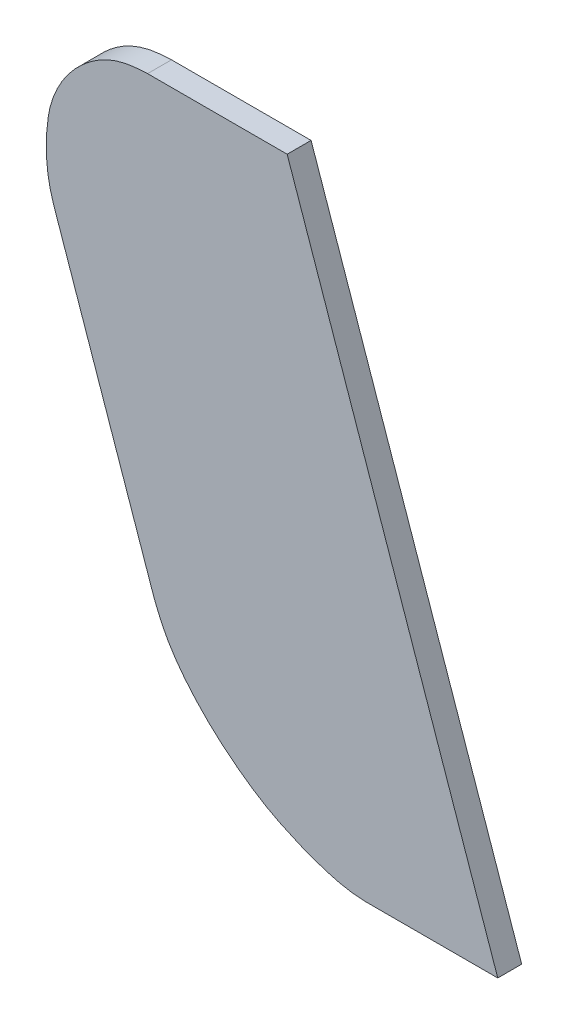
ISO-10303-21;
HEADER;
FILE_DESCRIPTION(('STEP AP214'),'2;1');
FILE_NAME('part.step','',(''),(''),'','','');
FILE_SCHEMA(('AUTOMOTIVE_DESIGN { 1 0 10303 214 1 1 1 1 }'));
ENDSEC;
DATA;
#1=APPLICATION_CONTEXT('core data for automotive mechanical design processes');
#2=APPLICATION_PROTOCOL_DEFINITION('international standard','automotive_design',2000,#1);
#3=PRODUCT_CONTEXT('',#1,'mechanical');
#4=PRODUCT('Part','Part','',(#3));
#5=PRODUCT_RELATED_PRODUCT_CATEGORY('part','',(#4));
#6=PRODUCT_DEFINITION_FORMATION('','',#4);
#7=PRODUCT_DEFINITION_CONTEXT('part definition',#1,'design');
#8=PRODUCT_DEFINITION('design','',#6,#7);
#9=PRODUCT_DEFINITION_SHAPE('','',#8);
#10=(LENGTH_UNIT() NAMED_UNIT(*) SI_UNIT(.MILLI.,.METRE.));
#11=(NAMED_UNIT(*) PLANE_ANGLE_UNIT() SI_UNIT($,.RADIAN.));
#12=(NAMED_UNIT(*) SI_UNIT($,.STERADIAN.) SOLID_ANGLE_UNIT());
#13=UNCERTAINTY_MEASURE_WITH_UNIT(LENGTH_MEASURE(1.E-05),#10,'distance_accuracy_value','');
#14=(GEOMETRIC_REPRESENTATION_CONTEXT(3) GLOBAL_UNCERTAINTY_ASSIGNED_CONTEXT((#13)) GLOBAL_UNIT_ASSIGNED_CONTEXT((#10,
#11,#12)) REPRESENTATION_CONTEXT('',''));
#15=CARTESIAN_POINT('',(0.,0.,0.));
#16=DIRECTION('',(0.,0.,1.));
#17=DIRECTION('',(1.,0.,0.));
#18=AXIS2_PLACEMENT_3D('',#15,#16,#17);
#19=CARTESIAN_POINT('',(0.,0.,0.8));
#20=DIRECTION('',(0.,0.,1.));
#21=DIRECTION('',(1.,0.,0.));
#22=AXIS2_PLACEMENT_3D('',#19,#20,#21);
#23=PLANE('',#22);
#24=DIRECTION('',(1.,0.,0.));
#25=VECTOR('',#24,1.);
#26=CARTESIAN_POINT('',(336.749341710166,203.769860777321,0.8));
#27=LINE('',#26,#25);
#28=CARTESIAN_POINT('',(336.749341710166,203.769860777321,0.8));
#29=VERTEX_POINT('',#28);
#30=CARTESIAN_POINT('',(332.31509172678,203.769860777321,0.8));
#31=VERTEX_POINT('',#30);
#32=EDGE_CURVE('E123',#29,#31,#27,.F.);
#33=ORIENTED_EDGE('',*,*,#32,.F.);
#34=DIRECTION('',(-0.32724357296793,0.944940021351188,0.));
#35=VECTOR('',#34,1.);
#36=CARTESIAN_POINT('',(329.704563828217,224.112177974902,0.8));
#37=LINE('',#36,#35);
#38=CARTESIAN_POINT('',(329.704563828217,224.112177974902,0.8));
#39=VERTEX_POINT('',#38);
#40=EDGE_CURVE('E117',#39,#29,#37,.F.);
#41=ORIENTED_EDGE('',*,*,#40,.F.);
#42=DIRECTION('',(1.,0.,0.));
#43=VECTOR('',#42,1.);
#44=CARTESIAN_POINT('',(325.035835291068,224.112177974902,0.8));
#45=LINE('',#44,#43);
#46=CARTESIAN_POINT('',(325.035835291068,224.112177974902,0.8));
#47=VERTEX_POINT('',#46);
#48=EDGE_CURVE('E110',#47,#39,#45,.T.);
#49=ORIENTED_EDGE('',*,*,#48,.F.);
#50=CARTESIAN_POINT('',(321.659344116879,220.709633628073,0.8));
#51=CARTESIAN_POINT('',(321.663379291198,220.754957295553,0.8));
#52=CARTESIAN_POINT('',(321.667413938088,220.800284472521,0.8));
#53=CARTESIAN_POINT('',(321.675904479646,220.891007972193,0.8));
#54=CARTESIAN_POINT('',(321.68036135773,220.93640420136,0.8));
#55=CARTESIAN_POINT('',(321.690107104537,221.027146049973,0.8));
#56=CARTESIAN_POINT('',(321.695396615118,221.072491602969,0.8));
#57=CARTESIAN_POINT('',(321.707229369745,221.163053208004,0.8));
#58=CARTESIAN_POINT('',(321.713773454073,221.208269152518,0.8));
#59=CARTESIAN_POINT('',(321.728519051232,221.298396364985,0.8));
#60=CARTESIAN_POINT('',(321.736719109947,221.343307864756,0.8));
#61=CARTESIAN_POINT('',(321.75519630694,221.432682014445,0.8));
#62=CARTESIAN_POINT('',(321.765472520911,221.477144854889,0.8));
#63=CARTESIAN_POINT('',(321.793508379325,221.587175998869,0.8));
#64=CARTESIAN_POINT('',(321.812470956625,221.652439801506,0.8));
#65=CARTESIAN_POINT('',(321.854394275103,221.781708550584,0.8));
#66=CARTESIAN_POINT('',(321.877357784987,221.845712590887,0.8));
#67=CARTESIAN_POINT('',(321.926868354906,221.972233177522,0.8));
#68=CARTESIAN_POINT('',(321.953411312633,222.034751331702,0.8));
#69=CARTESIAN_POINT('',(322.009894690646,222.158233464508,0.8));
#70=CARTESIAN_POINT('',(322.039835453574,222.219197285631,0.8));
#71=CARTESIAN_POINT('',(322.119278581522,222.369926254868,0.8));
#72=CARTESIAN_POINT('',(322.170979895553,222.458554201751,0.8));
#73=CARTESIAN_POINT('',(322.254337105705,222.587694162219,0.8));
#74=CARTESIAN_POINT('',(322.283090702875,222.630107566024,0.8));
#75=CARTESIAN_POINT('',(322.342459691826,222.713611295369,0.8));
#76=CARTESIAN_POINT('',(322.373075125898,222.754701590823,0.8));
#77=CARTESIAN_POINT('',(322.467570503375,222.876054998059,0.8));
#78=CARTESIAN_POINT('',(322.534047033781,222.954319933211,0.8));
#79=CARTESIAN_POINT('',(322.638165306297,223.067624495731,0.8));
#80=CARTESIAN_POINT('',(322.673614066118,223.104718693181,0.8));
#81=CARTESIAN_POINT('',(322.745893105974,223.177537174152,0.8));
#82=CARTESIAN_POINT('',(322.782723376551,223.213261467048,0.8));
#83=CARTESIAN_POINT('',(322.895606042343,223.318441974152,0.8));
#84=CARTESIAN_POINT('',(322.973801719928,223.385633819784,0.8));
#85=CARTESIAN_POINT('',(323.135845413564,223.512828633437,0.8));
#86=CARTESIAN_POINT('',(323.219693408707,223.572831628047,0.8));
#87=CARTESIAN_POINT('',(323.392634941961,223.684358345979,0.8));
#88=CARTESIAN_POINT('',(323.481715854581,223.735901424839,0.8));
#89=CARTESIAN_POINT('',(323.61894110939,223.80600862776,0.8));
#90=CARTESIAN_POINT('',(323.665271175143,223.828171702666,0.8));
#91=CARTESIAN_POINT('',(323.759072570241,223.869929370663,0.8));
#92=CARTESIAN_POINT('',(323.806543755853,223.889524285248,0.8));
#93=CARTESIAN_POINT('',(323.916708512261,223.931496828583,0.8));
#94=CARTESIAN_POINT('',(323.979744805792,223.952978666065,0.8));
#95=CARTESIAN_POINT('',(324.107219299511,223.991447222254,0.8));
#96=CARTESIAN_POINT('',(324.171658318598,224.008431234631,0.8));
#97=CARTESIAN_POINT('',(324.269142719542,224.030457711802,0.8));
#98=CARTESIAN_POINT('',(324.301805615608,224.037229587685,0.8));
#99=CARTESIAN_POINT('',(324.367356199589,224.049581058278,0.8));
#100=CARTESIAN_POINT('',(324.400243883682,224.055160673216,0.8));
#101=CARTESIAN_POINT('',(324.499818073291,224.070378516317,0.8));
#102=CARTESIAN_POINT('',(324.566758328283,224.078350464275,0.8));
#103=CARTESIAN_POINT('',(324.70083829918,224.091364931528,0.8));
#104=CARTESIAN_POINT('',(324.767977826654,224.096409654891,0.8));
#105=CARTESIAN_POINT('',(324.902032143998,224.105023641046,0.8));
#106=CARTESIAN_POINT('',(324.968946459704,224.108599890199,0.8));
#107=CARTESIAN_POINT('',(325.035835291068,224.112177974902,0.8));
#108=B_SPLINE_CURVE_WITH_KNOTS('',3,(#50,#51,#52,#53,#54,#55,#56,#57,#58,#59,#60,#61,#62,#63,
#64,#65,#66,#67,#68,#69,#70,#71,#72,#73,#74,#75,#76,#77,#78,#79,#80,#81,#82,#83,#84,#85,#86,#87,
#88,#89,#90,#91,#92,#93,#94,#95,#96,#97,#98,#99,#100,#101,#102,#103,#104,#105,#106,#107),
.UNSPECIFIED.,.F.,.F.,(4,2,2,2,2,2,2,2,2,2,2,2,2,2,2,2,2,2,2,2,2,2,2,2,2,2,2,2,4),(0.,
0.136514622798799,0.273355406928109,0.410302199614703,0.547341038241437,0.68426006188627,
0.821118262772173,1.02485773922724,1.22873877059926,1.43238809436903,1.6360579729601,
1.94341118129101,2.09709089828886,2.25077410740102,2.55842837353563,2.71232710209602,
2.86622477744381,3.17512249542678,3.48401907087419,3.79219875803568,3.94620969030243,
4.10020132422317,4.29982067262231,4.49955986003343,4.59961383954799,4.69966612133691,
4.90178585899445,5.10375321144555,5.30474823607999),.UNSPECIFIED.);
#109=CARTESIAN_POINT('',(321.659344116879,220.709633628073,0.8));
#110=VERTEX_POINT('',#109);
#111=EDGE_CURVE('E98',#110,#47,#108,.T.);
#112=ORIENTED_EDGE('',*,*,#111,.F.);
#113=CARTESIAN_POINT('',(321.893822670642,218.740013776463,0.8));
#114=CARTESIAN_POINT('',(321.884042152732,218.772009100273,0.8));
#115=CARTESIAN_POINT('',(321.874260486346,218.804005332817,0.8));
#116=CARTESIAN_POINT('',(321.854890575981,218.86806565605,0.8));
#117=CARTESIAN_POINT('',(321.845302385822,218.900129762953,0.8));
#118=CARTESIAN_POINT('',(321.826522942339,218.9643668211,0.8));
#119=CARTESIAN_POINT('',(321.817331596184,218.99653974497,0.8));
#120=CARTESIAN_POINT('',(321.799538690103,219.061045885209,0.8));
#121=CARTESIAN_POINT('',(321.790937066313,219.093379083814,0.8));
#122=CARTESIAN_POINT('',(321.774564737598,219.158194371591,0.8));
#123=CARTESIAN_POINT('',(321.766792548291,219.190676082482,0.8));
#124=CARTESIAN_POINT('',(321.752158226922,219.255844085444,0.8));
#125=CARTESIAN_POINT('',(321.745296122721,219.288530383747,0.8));
#126=CARTESIAN_POINT('',(321.725936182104,219.386838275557,0.8));
#127=CARTESIAN_POINT('',(321.714666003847,219.452703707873,0.8));
#128=CARTESIAN_POINT('',(321.697453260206,219.567687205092,0.8));
#129=CARTESIAN_POINT('',(321.690887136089,219.616715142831,0.8));
#130=CARTESIAN_POINT('',(321.679055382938,219.714928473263,0.8));
#131=CARTESIAN_POINT('',(321.673789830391,219.764113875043,0.8));
#132=CARTESIAN_POINT('',(321.660062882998,219.911853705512,0.8));
#133=CARTESIAN_POINT('',(321.653667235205,220.010618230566,0.8));
#134=CARTESIAN_POINT('',(321.648844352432,220.159504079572,0.8));
#135=CARTESIAN_POINT('',(321.648041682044,220.20955874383,0.8));
#136=CARTESIAN_POINT('',(321.647837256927,220.309669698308,0.8));
#137=CARTESIAN_POINT('',(321.648435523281,220.359725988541,0.8));
#138=CARTESIAN_POINT('',(321.650526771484,220.459771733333,0.8));
#139=CARTESIAN_POINT('',(321.652018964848,220.509761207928,0.8));
#140=CARTESIAN_POINT('',(321.655454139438,220.60971282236,0.8));
#141=CARTESIAN_POINT('',(321.657397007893,220.659674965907,0.8));
#142=CARTESIAN_POINT('',(321.659344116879,220.709633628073,0.8));
#143=B_SPLINE_CURVE_WITH_KNOTS('',3,(#113,#114,#115,#116,#117,#118,#119,#120,#121,#122,#123,
#124,#125,#126,#127,#128,#129,#130,#131,#132,#133,#134,#135,#136,#137,#138,#139,#140,#141,#142),
.UNSPECIFIED.,.F.,.F.,(4,2,2,2,2,2,2,2,2,2,2,2,2,2,4),(0.,0.100372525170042,0.200772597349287,
0.301149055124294,0.40151462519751,0.501697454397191,0.601883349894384,0.802271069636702,
0.950650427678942,1.09903850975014,1.39573446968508,1.54589718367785,1.69606215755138,
1.84609487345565,1.99609008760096),.UNSPECIFIED.);
#144=CARTESIAN_POINT('',(321.893822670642,218.740013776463,0.8));
#145=VERTEX_POINT('',#144);
#146=EDGE_CURVE('E24',#145,#110,#143,.T.);
#147=ORIENTED_EDGE('',*,*,#146,.F.);
#148=DIRECTION('',(0.32702335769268,-0.945016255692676,0.));
#149=VECTOR('',#148,1.);
#150=CARTESIAN_POINT('',(325.249471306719,209.043022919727,0.8));
#151=LINE('',#150,#149);
#152=CARTESIAN_POINT('',(325.249471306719,209.043022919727,0.8));
#153=VERTEX_POINT('',#152);
#154=EDGE_CURVE('E83',#153,#145,#151,.F.);
#155=ORIENTED_EDGE('',*,*,#154,.F.);
#156=CARTESIAN_POINT('',(330.131835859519,204.316977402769,0.8));
#157=CARTESIAN_POINT('',(330.07072773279,204.343575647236,0.8));
#158=CARTESIAN_POINT('',(330.009616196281,204.370173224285,0.8));
#159=CARTESIAN_POINT('',(329.887551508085,204.423781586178,0.8));
#160=CARTESIAN_POINT('',(329.826598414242,204.450792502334,0.8));
#161=CARTESIAN_POINT('',(329.705053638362,204.505626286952,0.8));
#162=CARTESIAN_POINT('',(329.644461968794,204.533449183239,0.8));
#163=CARTESIAN_POINT('',(329.523845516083,204.5902849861,0.8));
#164=CARTESIAN_POINT('',(329.463820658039,204.619297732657,0.8));
#165=CARTESIAN_POINT('',(329.344185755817,204.67915471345,0.8));
#166=CARTESIAN_POINT('',(329.284581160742,204.710009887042,0.8));
#167=CARTESIAN_POINT('',(329.166276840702,204.773412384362,0.8));
#168=CARTESIAN_POINT('',(329.107577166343,204.805959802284,0.8));
#169=CARTESIAN_POINT('',(328.932811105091,204.905890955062,0.8));
#170=CARTESIAN_POINT('',(328.818055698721,204.975574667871,0.8));
#171=CARTESIAN_POINT('',(328.552473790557,205.14531478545,0.8));
#172=CARTESIAN_POINT('',(328.403008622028,205.247494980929,0.8));
#173=CARTESIAN_POINT('',(328.109541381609,205.45963184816,0.8));
#174=CARTESIAN_POINT('',(327.965544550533,205.569595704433,0.8));
#175=CARTESIAN_POINT('',(327.682525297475,205.795907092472,0.8));
#176=CARTESIAN_POINT('',(327.543505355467,205.912257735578,0.8));
#177=CARTESIAN_POINT('',(327.339939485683,206.091973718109,0.8));
#178=CARTESIAN_POINT('',(327.273011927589,206.152645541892,0.8));
#179=CARTESIAN_POINT('',(327.14091073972,206.275865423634,0.8));
#180=CARTESIAN_POINT('',(327.075737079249,206.338413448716,0.8));
#181=CARTESIAN_POINT('',(326.883057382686,206.528747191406,0.8));
#182=CARTESIAN_POINT('',(326.758279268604,206.65932232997,0.8));
#183=CARTESIAN_POINT('',(326.57673731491,206.86016881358,0.8));
#184=CARTESIAN_POINT('',(326.517169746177,206.927937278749,0.8));
#185=CARTESIAN_POINT('',(326.399980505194,207.065135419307,0.8));
#186=CARTESIAN_POINT('',(326.342358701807,207.134564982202,0.8));
#187=CARTESIAN_POINT('',(326.212329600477,207.296671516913,0.8));
#188=CARTESIAN_POINT('',(326.140741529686,207.390009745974,0.8));
#189=CARTESIAN_POINT('',(326.002474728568,207.58022516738,0.8));
#190=CARTESIAN_POINT('',(325.935794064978,207.677100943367,0.8));
#191=CARTESIAN_POINT('',(325.840108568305,207.8251835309,0.8));
#192=CARTESIAN_POINT('',(325.80893954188,207.87499960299,0.8));
#193=CARTESIAN_POINT('',(325.748140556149,207.975565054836,0.8));
#194=CARTESIAN_POINT('',(325.718510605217,208.026314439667,0.8));
#195=CARTESIAN_POINT('',(325.660811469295,208.12888401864,0.8));
#196=CARTESIAN_POINT('',(325.632746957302,208.180706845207,0.8));
#197=CARTESIAN_POINT('',(325.578433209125,208.285290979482,0.8));
#198=CARTESIAN_POINT('',(325.55218382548,208.338052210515,0.8));
#199=CARTESIAN_POINT('',(325.501399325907,208.444474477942,0.8));
#200=CARTESIAN_POINT('',(325.476866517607,208.498136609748,0.8));
#201=CARTESIAN_POINT('',(325.429082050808,208.606035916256,0.8));
#202=CARTESIAN_POINT('',(325.405830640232,208.660273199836,0.8));
#203=CARTESIAN_POINT('',(325.360169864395,208.769186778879,0.8));
#204=CARTESIAN_POINT('',(325.337761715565,208.823863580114,0.8));
#205=CARTESIAN_POINT('',(325.293393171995,208.933369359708,0.8));
#206=CARTESIAN_POINT('',(325.271432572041,208.988198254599,0.8));
#207=CARTESIAN_POINT('',(325.249471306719,209.043022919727,0.8));
#208=B_SPLINE_CURVE_WITH_KNOTS('',3,(#156,#157,#158,#159,#160,#161,#162,#163,#164,#165,#166,
#167,#168,#169,#170,#171,#172,#173,#174,#175,#176,#177,#178,#179,#180,#181,#182,#183,#184,#185,
#186,#187,#188,#189,#190,#191,#192,#193,#194,#195,#196,#197,#198,#199,#200,#201,#202,#203,#204,
#205,#206,#207),.UNSPECIFIED.,.F.,.F.,(4,2,2,2,2,2,2,2,2,2,2,2,2,2,2,2,2,2,2,2,2,2,2,2,2,4),(0.,
0.19994242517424,0.39994974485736,0.599963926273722,0.79995129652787,1.00127453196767,
1.20260898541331,1.60520414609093,2.14805610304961,2.69141583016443,3.23504264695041,
3.50601334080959,3.77697928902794,4.31845883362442,4.58911393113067,4.85975075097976,
5.21251178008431,5.56513308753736,5.74140052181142,5.91766891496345,6.09443805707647,
6.27119282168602,6.44818080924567,6.62520292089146,6.80247130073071,6.97965648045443),.UNSPECIFIED.);
#209=CARTESIAN_POINT('',(330.131835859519,204.316977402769,0.8));
#210=VERTEX_POINT('',#209);
#211=EDGE_CURVE('E105',#210,#153,#208,.T.);
#212=ORIENTED_EDGE('',*,*,#211,.F.);
#213=CARTESIAN_POINT('',(332.31509172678,203.769860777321,0.8));
#214=CARTESIAN_POINT('',(332.281653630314,203.771855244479,0.8));
#215=CARTESIAN_POINT('',(332.248214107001,203.7738487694,0.8));
#216=CARTESIAN_POINT('',(332.181338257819,203.778053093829,0.8));
#217=CARTESIAN_POINT('',(332.147901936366,203.780263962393,0.8));
#218=CARTESIAN_POINT('',(332.08105492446,203.785121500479,0.8));
#219=CARTESIAN_POINT('',(332.047644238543,203.787768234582,0.8));
#220=CARTESIAN_POINT('',(331.980883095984,203.793706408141,0.8));
#221=CARTESIAN_POINT('',(331.947532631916,203.796997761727,0.8));
#222=CARTESIAN_POINT('',(331.881072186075,203.80445658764,0.8));
#223=CARTESIAN_POINT('',(331.847961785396,203.808620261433,0.8));
#224=CARTESIAN_POINT('',(331.78187171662,203.817885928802,0.8));
#225=CARTESIAN_POINT('',(331.748892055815,203.822987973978,0.8));
#226=CARTESIAN_POINT('',(331.650178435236,203.839533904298,0.8));
#227=CARTESIAN_POINT('',(331.584651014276,203.85221977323,0.8));
#228=CARTESIAN_POINT('',(331.460209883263,203.878966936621,0.8));
#229=CARTESIAN_POINT('',(331.401244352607,203.892792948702,0.8));
#230=CARTESIAN_POINT('',(331.283741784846,203.92218565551,0.8));
#231=CARTESIAN_POINT('',(331.225204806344,203.937752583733,0.8));
#232=CARTESIAN_POINT('',(331.108484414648,203.970518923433,0.8));
#233=CARTESIAN_POINT('',(331.050301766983,203.987721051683,0.8));
#234=CARTESIAN_POINT('',(330.934390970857,204.02357243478,0.8));
#235=CARTESIAN_POINT('',(330.876662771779,204.042221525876,0.8));
#236=CARTESIAN_POINT('',(330.703138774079,204.10052659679,0.8));
#237=CARTESIAN_POINT('',(330.588045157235,204.142243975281,0.8));
#238=CARTESIAN_POINT('',(330.359217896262,204.228299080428,0.8));
#239=CARTESIAN_POINT('',(330.245481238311,204.272628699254,0.8));
#240=CARTESIAN_POINT('',(330.131835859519,204.316977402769,0.8));
#241=B_SPLINE_CURVE_WITH_KNOTS('',3,(#213,#214,#215,#216,#217,#218,#219,#220,#221,#222,#223,
#224,#225,#226,#227,#228,#229,#230,#231,#232,#233,#234,#235,#236,#237,#238,#239,#240),
.UNSPECIFIED.,.F.,.F.,(4,2,2,2,2,2,2,2,2,2,2,2,2,4),(0.,0.100494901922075,0.201021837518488,
0.301563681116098,0.402092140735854,0.502191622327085,0.60229661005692,0.802449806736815,
0.984115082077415,1.16580475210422,1.34780174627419,1.52977817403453,1.89697563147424,
2.26308796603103),.UNSPECIFIED.);
#242=EDGE_CURVE('E199',#31,#210,#241,.T.);
#243=ORIENTED_EDGE('',*,*,#242,.F.);
#244=EDGE_LOOP('',(#33,#41,#49,#112,#147,#155,#212,#243));
#245=FACE_BOUND('',#244,.T.);
#246=ADVANCED_FACE('F17',(#245),#23,.T.);
#247=CARTESIAN_POINT('',(321.893822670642,218.740013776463,0.8));
#248=CARTESIAN_POINT('',(321.893822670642,218.740013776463,0.));
#249=CARTESIAN_POINT('',(321.848932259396,218.886856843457,0.8));
#250=CARTESIAN_POINT('',(321.848932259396,218.886856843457,0.));
#251=CARTESIAN_POINT('',(321.756580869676,219.188951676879,0.8));
#252=CARTESIAN_POINT('',(321.756580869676,219.188951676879,0.));
#253=CARTESIAN_POINT('',(321.677281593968,219.668164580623,0.8));
#254=CARTESIAN_POINT('',(321.677281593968,219.668164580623,0.));
#255=CARTESIAN_POINT('',(321.638709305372,220.179378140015,0.8));
#256=CARTESIAN_POINT('',(321.638709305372,220.179378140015,0.));
#257=CARTESIAN_POINT('',(321.652313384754,220.528963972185,0.8));
#258=CARTESIAN_POINT('',(321.652313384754,220.528963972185,0.));
#259=CARTESIAN_POINT('',(321.659344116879,220.709633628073,0.8));
#260=CARTESIAN_POINT('',(321.659344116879,220.709633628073,0.));
#261=B_SPLINE_SURFACE_WITH_KNOTS('',3,1,((#247,#248),(#249,#250),(#251,#252),(#253,#254),(#255,
#256),(#257,#258),(#259,#260)),.UNSPECIFIED.,.F.,.F.,.F.,(4,1,1,1,4),(2,2),(0.,
0.230623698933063,0.47445364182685,0.728392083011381,1.),(0.,1.),.UNSPECIFIED.);
#262=DIRECTION('',(0.,0.,1.));
#263=VECTOR('',#262,1.);
#264=CARTESIAN_POINT('',(321.659344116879,220.709633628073,0.4));
#265=LINE('',#264,#263);
#266=CARTESIAN_POINT('',(321.659344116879,220.709633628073,0.));
#267=VERTEX_POINT('',#266);
#268=EDGE_CURVE('E220',#267,#110,#265,.T.);
#269=CARTESIAN_POINT('',(321.659344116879,220.709633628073,0.));
#270=CARTESIAN_POINT('',(321.656748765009,220.64300246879,0.));
#271=CARTESIAN_POINT('',(321.654155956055,220.576352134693,0.));
#272=CARTESIAN_POINT('',(321.650039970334,220.442969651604,0.));
#273=CARTESIAN_POINT('',(321.648517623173,220.376237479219,0.));
#274=CARTESIAN_POINT('',(321.64783996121,220.276083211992,0.));
#275=CARTESIAN_POINT('',(321.647882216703,220.242669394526,0.));
#276=CARTESIAN_POINT('',(321.648655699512,220.17585012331,0.));
#277=CARTESIAN_POINT('',(321.649386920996,220.14244466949,0.));
#278=CARTESIAN_POINT('',(321.652661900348,220.042288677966,0.));
#279=CARTESIAN_POINT('',(321.656286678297,219.975570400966,0.));
#280=CARTESIAN_POINT('',(321.664883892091,219.859680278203,0.));
#281=CARTESIAN_POINT('',(321.669259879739,219.810461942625,0.));
#282=CARTESIAN_POINT('',(321.679352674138,219.71215095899,0.));
#283=CARTESIAN_POINT('',(321.685069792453,219.663058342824,0.));
#284=CARTESIAN_POINT('',(321.69784375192,219.56507706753,0.));
#285=CARTESIAN_POINT('',(321.704899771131,219.516188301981,0.));
#286=CARTESIAN_POINT('',(321.720597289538,219.418678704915,0.));
#287=CARTESIAN_POINT('',(321.729238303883,219.370057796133,0.));
#288=CARTESIAN_POINT('',(321.748473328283,219.272409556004,0.));
#289=CARTESIAN_POINT('',(321.759095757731,219.223387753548,0.));
#290=CARTESIAN_POINT('',(321.782391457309,219.125817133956,0.));
#291=CARTESIAN_POINT('',(321.795065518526,219.077268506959,0.));
#292=CARTESIAN_POINT('',(321.821758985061,218.980483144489,0.));
#293=CARTESIAN_POINT('',(321.835780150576,218.932246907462,0.));
#294=CARTESIAN_POINT('',(321.864475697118,218.836009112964,0.));
#295=CARTESIAN_POINT('',(321.879149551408,218.788007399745,0.));
#296=CARTESIAN_POINT('',(321.893822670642,218.740013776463,0.));
#297=B_SPLINE_CURVE_WITH_KNOTS('',3,(#269,#270,#271,#272,#273,#274,#275,#276,#277,#278,#279,
#280,#281,#282,#283,#284,#285,#286,#287,#288,#289,#290,#291,#292,#293,#294,#295,#296),
.UNSPECIFIED.,.F.,.F.,(4,2,2,2,2,2,2,2,2,2,2,2,2,4),(0.,0.200078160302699,0.400311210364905,
0.500546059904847,0.600780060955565,0.801163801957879,0.949384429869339,1.09763952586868,
1.24580390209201,1.39392303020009,1.5443577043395,1.69485052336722,1.84554273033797,
1.99611545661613),.UNSPECIFIED.);
#298=CARTESIAN_POINT('',(321.893822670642,218.740013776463,0.));
#299=VERTEX_POINT('',#298);
#300=EDGE_CURVE('E104',#267,#299,#297,.T.);
#301=DIRECTION('',(0.,0.,1.));
#302=VECTOR('',#301,1.);
#303=CARTESIAN_POINT('',(321.893822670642,218.740013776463,0.8));
#304=LINE('',#303,#302);
#305=EDGE_CURVE('E88',#145,#299,#304,.F.);
#306=ORIENTED_EDGE('',*,*,#146,.T.);
#307=ORIENTED_EDGE('',*,*,#268,.F.);
#308=ORIENTED_EDGE('',*,*,#300,.T.);
#309=ORIENTED_EDGE('',*,*,#305,.F.);
#310=EDGE_LOOP('',(#306,#307,#308,#309));
#311=FACE_BOUND('',#310,.T.);
#312=ADVANCED_FACE('F103',(#311),#261,.T.);
#313=CARTESIAN_POINT('',(325.249471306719,209.043022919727,0.8));
#314=DIRECTION('',(-0.945016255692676,-0.32702335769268,0.));
#315=DIRECTION('',(0.32702335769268,-0.945016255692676,0.));
#316=AXIS2_PLACEMENT_3D('',#313,#314,#315);
#317=PLANE('',#316);
#318=ORIENTED_EDGE('',*,*,#154,.T.);
#319=ORIENTED_EDGE('',*,*,#305,.T.);
#320=DIRECTION('',(0.327023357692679,-0.945016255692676,0.));
#321=VECTOR('',#320,1.);
#322=CARTESIAN_POINT('',(321.893822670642,218.740013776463,0.));
#323=LINE('',#322,#321);
#324=CARTESIAN_POINT('',(325.249471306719,209.043022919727,0.));
#325=VERTEX_POINT('',#324);
#326=EDGE_CURVE('E161',#299,#325,#323,.T.);
#327=ORIENTED_EDGE('',*,*,#326,.T.);
#328=DIRECTION('',(0.,0.,-1.));
#329=VECTOR('',#328,1.);
#330=CARTESIAN_POINT('',(325.249471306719,209.043022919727,0.4));
#331=LINE('',#330,#329);
#332=EDGE_CURVE('E90',#153,#325,#331,.T.);
#333=ORIENTED_EDGE('',*,*,#332,.F.);
#334=EDGE_LOOP('',(#318,#319,#327,#333));
#335=FACE_BOUND('',#334,.T.);
#336=ADVANCED_FACE('F85',(#335),#317,.T.);
#337=CARTESIAN_POINT('',(330.131835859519,204.316977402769,0.8));
#338=CARTESIAN_POINT('',(330.131835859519,204.316977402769,0.));
#339=CARTESIAN_POINT('',(329.86511730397,204.433064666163,0.8));
#340=CARTESIAN_POINT('',(329.86511730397,204.433064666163,0.));
#341=CARTESIAN_POINT('',(329.328329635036,204.666697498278,0.8));
#342=CARTESIAN_POINT('',(329.328329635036,204.666697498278,0.));
#343=CARTESIAN_POINT('',(328.563295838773,205.122835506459,0.8));
#344=CARTESIAN_POINT('',(328.563295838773,205.122835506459,0.));
#345=CARTESIAN_POINT('',(327.829743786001,205.663229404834,0.8));
#346=CARTESIAN_POINT('',(327.829743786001,205.663229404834,0.));
#347=CARTESIAN_POINT('',(327.129183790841,206.266339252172,0.8));
#348=CARTESIAN_POINT('',(327.129183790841,206.266339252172,0.));
#349=CARTESIAN_POINT('',(326.502063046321,206.925237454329,0.8));
#350=CARTESIAN_POINT('',(326.502063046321,206.925237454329,0.));
#351=CARTESIAN_POINT('',(325.963969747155,207.605186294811,0.8));
#352=CARTESIAN_POINT('',(325.963969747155,207.605186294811,0.));
#353=CARTESIAN_POINT('',(325.542932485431,208.310368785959,0.8));
#354=CARTESIAN_POINT('',(325.542932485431,208.310368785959,0.));
#355=CARTESIAN_POINT('',(325.345914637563,208.802242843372,0.8));
#356=CARTESIAN_POINT('',(325.345914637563,208.802242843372,0.));
#357=CARTESIAN_POINT('',(325.249471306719,209.043022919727,0.8));
#358=CARTESIAN_POINT('',(325.249471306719,209.043022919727,0.));
#359=B_SPLINE_SURFACE_WITH_KNOTS('',3,1,((#337,#338),(#339,#340),(#341,#342),(#343,#344),(#345,
#346),(#347,#348),(#349,#350),(#351,#352),(#353,#354),(#355,#356),(#357,#358)),.UNSPECIFIED.,
.F.,.F.,.F.,(4,1,1,1,1,1,1,1,4),(2,2),(0.,0.124973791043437,0.251517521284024,0.38192053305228,
0.516387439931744,0.648443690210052,0.772434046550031,0.888602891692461,1.),(0.,1.),.UNSPECIFIED.);
#360=CARTESIAN_POINT('',(325.249471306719,209.043022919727,0.));
#361=CARTESIAN_POINT('',(325.274487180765,208.980565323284,0.));
#362=CARTESIAN_POINT('',(325.299506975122,208.91810202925,0.));
#363=CARTESIAN_POINT('',(325.350211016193,208.793393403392,0.));
#364=CARTESIAN_POINT('',(325.375895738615,208.731148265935,0.));
#365=CARTESIAN_POINT('',(325.428545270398,208.607212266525,0.));
#366=CARTESIAN_POINT('',(325.455509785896,208.545521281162,0.));
#367=CARTESIAN_POINT('',(325.511367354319,208.423033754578,0.));
#368=CARTESIAN_POINT('',(325.540259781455,208.362236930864,0.));
#369=CARTESIAN_POINT('',(325.600320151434,208.242184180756,0.));
#370=CARTESIAN_POINT('',(325.631474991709,208.182921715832,0.));
#371=CARTESIAN_POINT('',(325.695965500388,208.065588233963,0.));
#372=CARTESIAN_POINT('',(325.729301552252,208.007517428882,0.));
#373=CARTESIAN_POINT('',(325.832329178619,207.835147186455,0.));
#374=CARTESIAN_POINT('',(325.905059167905,207.722652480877,0.));
#375=CARTESIAN_POINT('',(326.071840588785,207.481518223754,0.));
#376=CARTESIAN_POINT('',(326.167317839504,207.353870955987,0.));
#377=CARTESIAN_POINT('',(326.316161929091,207.166828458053,0.));
#378=CARTESIAN_POINT('',(326.366747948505,207.105181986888,0.));
#379=CARTESIAN_POINT('',(326.469505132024,206.983225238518,0.));
#380=CARTESIAN_POINT('',(326.521676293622,206.9229149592,0.));
#381=CARTESIAN_POINT('',(326.680394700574,206.743889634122,0.));
#382=CARTESIAN_POINT('',(326.789132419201,206.627098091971,0.));
#383=CARTESIAN_POINT('',(326.956912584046,206.455751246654,0.));
#384=CARTESIAN_POINT('',(327.013820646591,206.399088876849,0.));
#385=CARTESIAN_POINT('',(327.129078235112,206.287249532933,0.));
#386=CARTESIAN_POINT('',(327.187427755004,206.232072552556,0.));
#387=CARTESIAN_POINT('',(327.36442534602,206.068815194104,0.));
#388=CARTESIAN_POINT('',(327.485104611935,205.962924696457,0.));
#389=CARTESIAN_POINT('',(327.669466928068,205.808103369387,0.));
#390=CARTESIAN_POINT('',(327.731483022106,205.757161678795,0.));
#391=CARTESIAN_POINT('',(327.856517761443,205.656523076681,0.));
#392=CARTESIAN_POINT('',(327.91953640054,205.606826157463,0.));
#393=CARTESIAN_POINT('',(328.093270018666,205.472740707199,0.));
#394=CARTESIAN_POINT('',(328.205019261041,205.389682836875,0.));
#395=CARTESIAN_POINT('',(328.431844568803,205.228288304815,0.));
#396=CARTESIAN_POINT('',(328.546919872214,205.149950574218,0.));
#397=CARTESIAN_POINT('',(328.780591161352,204.998764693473,0.));
#398=CARTESIAN_POINT('',(328.899185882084,204.925914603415,0.));
#399=CARTESIAN_POINT('',(329.07910389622,204.821975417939,0.));
#400=CARTESIAN_POINT('',(329.139011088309,204.788423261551,0.));
#401=CARTESIAN_POINT('',(329.259765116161,204.723059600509,0.));
#402=CARTESIAN_POINT('',(329.320611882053,204.691247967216,0.));
#403=CARTESIAN_POINT('',(329.443246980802,204.629374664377,0.));
#404=CARTESIAN_POINT('',(329.505036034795,204.599314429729,0.));
#405=CARTESIAN_POINT('',(329.629239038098,204.540497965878,0.));
#406=CARTESIAN_POINT('',(329.691653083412,204.511741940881,0.));
#407=CARTESIAN_POINT('',(329.816942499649,204.455089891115,0.));
#408=CARTESIAN_POINT('',(329.879818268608,204.42719475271,0.));
#409=CARTESIAN_POINT('',(330.005742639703,204.371859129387,0.));
#410=CARTESIAN_POINT('',(330.068791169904,204.344418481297,0.));
#411=CARTESIAN_POINT('',(330.131835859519,204.316977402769,0.));
#412=B_SPLINE_CURVE_WITH_KNOTS('',3,(#360,#361,#362,#363,#364,#365,#366,#367,#368,#369,#370,
#371,#372,#373,#374,#375,#376,#377,#378,#379,#380,#381,#382,#383,#384,#385,#386,#387,#388,#389,
#390,#391,#392,#393,#394,#395,#396,#397,#398,#399,#400,#401,#402,#403,#404,#405,#406,#407,#408,
#409,#410,#411),.UNSPECIFIED.,.F.,.F.,(4,2,2,2,2,2,2,2,2,2,2,2,2,2,2,2,2,2,2,2,2,2,2,2,2,4),(0.,
0.201854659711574,0.403857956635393,0.605815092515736,0.807706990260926,1.00851083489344,
1.20935007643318,1.61090297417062,2.08873198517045,2.32794486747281,2.56715737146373,
3.04565153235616,3.28654947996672,3.52744641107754,4.00888880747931,4.24964593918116,
4.4904015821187,4.90799630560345,5.32549610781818,5.74284762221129,5.94881376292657,
6.15476466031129,6.36088198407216,6.56703147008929,6.77338656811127,6.97966589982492),.UNSPECIFIED.);
#413=CARTESIAN_POINT('',(330.131835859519,204.316977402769,0.));
#414=VERTEX_POINT('',#413);
#415=EDGE_CURVE('E148',#325,#414,#412,.T.);
#416=DIRECTION('',(0.,0.,-1.));
#417=VECTOR('',#416,1.);
#418=CARTESIAN_POINT('',(330.131835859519,204.316977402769,0.4));
#419=LINE('',#418,#417);
#420=EDGE_CURVE('E125',#210,#414,#419,.T.);
#421=ORIENTED_EDGE('',*,*,#211,.T.);
#422=ORIENTED_EDGE('',*,*,#332,.T.);
#423=ORIENTED_EDGE('',*,*,#415,.T.);
#424=ORIENTED_EDGE('',*,*,#420,.F.);
#425=EDGE_LOOP('',(#421,#422,#423,#424));
#426=FACE_BOUND('',#425,.T.);
#427=ADVANCED_FACE('F173',(#426),#359,.T.);
#428=CARTESIAN_POINT('',(332.31509172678,203.769860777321,0.8));
#429=CARTESIAN_POINT('',(332.31509172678,203.769860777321,0.));
#430=CARTESIAN_POINT('',(332.165347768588,203.77878952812,0.8));
#431=CARTESIAN_POINT('',(332.165347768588,203.77878952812,0.));
#432=CARTESIAN_POINT('',(331.840656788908,203.798149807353,0.8));
#433=CARTESIAN_POINT('',(331.840656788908,203.798149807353,0.));
#434=CARTESIAN_POINT('',(331.323500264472,203.903236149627,0.8));
#435=CARTESIAN_POINT('',(331.323500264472,203.903236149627,0.));
#436=CARTESIAN_POINT('',(330.744446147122,204.078111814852,0.8));
#437=CARTESIAN_POINT('',(330.744446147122,204.078111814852,0.));
#438=CARTESIAN_POINT('',(330.344413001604,204.234090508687,0.8));
#439=CARTESIAN_POINT('',(330.344413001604,204.234090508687,0.));
#440=CARTESIAN_POINT('',(330.131835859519,204.316977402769,0.8));
#441=CARTESIAN_POINT('',(330.131835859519,204.316977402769,0.));
#442=B_SPLINE_SURFACE_WITH_KNOTS('',3,1,((#428,#429),(#430,#431),(#432,#433),(#434,#435),(#436,
#437),(#438,#439),(#440,#441)),.UNSPECIFIED.,.F.,.F.,.F.,(4,1,1,1,4),(2,2),(0.,
0.198714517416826,0.43087422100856,0.697567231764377,1.),(0.,1.),.UNSPECIFIED.);
#443=CARTESIAN_POINT('',(330.131835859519,204.316977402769,0.));
#444=CARTESIAN_POINT('',(330.193847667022,204.292796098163,0.));
#445=CARTESIAN_POINT('',(330.255863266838,204.26861627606,0.));
#446=CARTESIAN_POINT('',(330.380086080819,204.220689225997,0.));
#447=CARTESIAN_POINT('',(330.442293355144,204.196942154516,0.));
#448=CARTESIAN_POINT('',(330.567248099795,204.150250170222,0.));
#449=CARTESIAN_POINT('',(330.629996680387,204.127308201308,0.));
#450=CARTESIAN_POINT('',(330.755971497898,204.082800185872,0.));
#451=CARTESIAN_POINT('',(330.819197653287,204.061233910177,0.));
#452=CARTESIAN_POINT('',(330.940121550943,204.021759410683,0.));
#453=CARTESIAN_POINT('',(330.99776937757,204.003698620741,0.));
#454=CARTESIAN_POINT('',(331.113523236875,203.969072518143,0.));
#455=CARTESIAN_POINT('',(331.171629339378,203.952507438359,0.));
#456=CARTESIAN_POINT('',(331.288180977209,203.921035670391,0.));
#457=CARTESIAN_POINT('',(331.346625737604,203.906126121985,0.));
#458=CARTESIAN_POINT('',(331.463947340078,203.878164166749,0.));
#459=CARTESIAN_POINT('',(331.522824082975,203.865111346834,0.));
#460=CARTESIAN_POINT('',(331.642164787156,203.841141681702,0.));
#461=CARTESIAN_POINT('',(331.70263786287,203.830269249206,0.));
#462=CARTESIAN_POINT('',(331.793697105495,203.816167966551,0.));
#463=CARTESIAN_POINT('',(331.82411382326,203.811834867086,0.));
#464=CARTESIAN_POINT('',(331.885052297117,203.803985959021,0.));
#465=CARTESIAN_POINT('',(331.915574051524,203.800470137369,0.));
#466=CARTESIAN_POINT('',(331.97680613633,203.794102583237,0.));
#467=CARTESIAN_POINT('',(332.007516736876,203.791253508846,0.));
#468=CARTESIAN_POINT('',(332.068982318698,203.786061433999,0.));
#469=CARTESIAN_POINT('',(332.099737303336,203.783718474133,0.));
#470=CARTESIAN_POINT('',(332.161256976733,203.779371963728,0.));
#471=CARTESIAN_POINT('',(332.192021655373,203.777368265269,0.));
#472=CARTESIAN_POINT('',(332.253555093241,203.773530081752,0.));
#473=CARTESIAN_POINT('',(332.284323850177,203.77169556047,0.));
#474=CARTESIAN_POINT('',(332.31509172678,203.769860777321,0.));
#475=B_SPLINE_CURVE_WITH_KNOTS('',3,(#443,#444,#445,#446,#447,#448,#449,#450,#451,#452,#453,
#454,#455,#456,#457,#458,#459,#460,#461,#462,#463,#464,#465,#466,#467,#468,#469,#470,#471,#472,
#473,#474),.UNSPECIFIED.,.F.,.F.,(4,2,2,2,2,2,2,2,2,2,2,2,2,2,2,4),(0.,0.199684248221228,
0.399439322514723,0.599861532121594,0.800250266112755,0.981463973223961,1.16270584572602,
1.3436295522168,1.52451294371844,1.70877234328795,1.80093437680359,1.89309493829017,
1.98561688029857,2.07814623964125,2.17063515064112,2.2631042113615),.UNSPECIFIED.);
#476=CARTESIAN_POINT('',(332.31509172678,203.769860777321,0.));
#477=VERTEX_POINT('',#476);
#478=EDGE_CURVE('E133',#414,#477,#475,.T.);
#479=DIRECTION('',(0.,0.,-1.));
#480=VECTOR('',#479,1.);
#481=CARTESIAN_POINT('',(332.31509172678,203.769860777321,0.8));
#482=LINE('',#481,#480);
#483=EDGE_CURVE('E120',#31,#477,#482,.T.);
#484=ORIENTED_EDGE('',*,*,#242,.T.);
#485=ORIENTED_EDGE('',*,*,#420,.T.);
#486=ORIENTED_EDGE('',*,*,#478,.T.);
#487=ORIENTED_EDGE('',*,*,#483,.F.);
#488=EDGE_LOOP('',(#484,#485,#486,#487));
#489=FACE_BOUND('',#488,.T.);
#490=ADVANCED_FACE('F184',(#489),#442,.T.);
#491=CARTESIAN_POINT('',(336.749341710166,203.769860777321,0.8));
#492=DIRECTION('',(0.,-1.,0.));
#493=DIRECTION('',(0.,0.,-1.));
#494=AXIS2_PLACEMENT_3D('',#491,#492,#493);
#495=PLANE('',#494);
#496=ORIENTED_EDGE('',*,*,#32,.T.);
#497=ORIENTED_EDGE('',*,*,#483,.T.);
#498=DIRECTION('',(1.,0.,0.));
#499=VECTOR('',#498,1.);
#500=CARTESIAN_POINT('',(0.,203.769860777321,0.));
#501=LINE('',#500,#499);
#502=CARTESIAN_POINT('',(336.749341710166,203.769860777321,0.));
#503=VERTEX_POINT('',#502);
#504=EDGE_CURVE('E228',#477,#503,#501,.T.);
#505=ORIENTED_EDGE('',*,*,#504,.T.);
#506=DIRECTION('',(0.,0.,1.));
#507=VECTOR('',#506,1.);
#508=CARTESIAN_POINT('',(336.749341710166,203.769860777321,0.8));
#509=LINE('',#508,#507);
#510=EDGE_CURVE('E114',#29,#503,#509,.F.);
#511=ORIENTED_EDGE('',*,*,#510,.F.);
#512=EDGE_LOOP('',(#496,#497,#505,#511));
#513=FACE_BOUND('',#512,.T.);
#514=ADVANCED_FACE('F237',(#513),#495,.T.);
#515=CARTESIAN_POINT('',(329.704563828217,224.112177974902,0.8));
#516=DIRECTION('',(0.944940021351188,0.32724357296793,0.));
#517=DIRECTION('',(-0.32724357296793,0.944940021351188,0.));
#518=AXIS2_PLACEMENT_3D('',#515,#516,#517);
#519=PLANE('',#518);
#520=ORIENTED_EDGE('',*,*,#40,.T.);
#521=ORIENTED_EDGE('',*,*,#510,.T.);
#522=DIRECTION('',(-0.327243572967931,0.944940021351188,0.));
#523=VECTOR('',#522,1.);
#524=CARTESIAN_POINT('',(336.749341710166,203.769860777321,0.));
#525=LINE('',#524,#523);
#526=CARTESIAN_POINT('',(329.704563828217,224.112177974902,0.));
#527=VERTEX_POINT('',#526);
#528=EDGE_CURVE('E225',#503,#527,#525,.T.);
#529=ORIENTED_EDGE('',*,*,#528,.T.);
#530=DIRECTION('',(0.,0.,1.));
#531=VECTOR('',#530,1.);
#532=CARTESIAN_POINT('',(329.704563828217,224.112177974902,0.8));
#533=LINE('',#532,#531);
#534=EDGE_CURVE('E113',#39,#527,#533,.F.);
#535=ORIENTED_EDGE('',*,*,#534,.F.);
#536=EDGE_LOOP('',(#520,#521,#529,#535));
#537=FACE_BOUND('',#536,.T.);
#538=ADVANCED_FACE('F245',(#537),#519,.T.);
#539=CARTESIAN_POINT('',(325.035835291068,224.112177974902,0.8));
#540=DIRECTION('',(0.,1.,0.));
#541=DIRECTION('',(0.,0.,1.));
#542=AXIS2_PLACEMENT_3D('',#539,#540,#541);
#543=PLANE('',#542);
#544=ORIENTED_EDGE('',*,*,#48,.T.);
#545=ORIENTED_EDGE('',*,*,#534,.T.);
#546=DIRECTION('',(1.,0.,0.));
#547=VECTOR('',#546,1.);
#548=CARTESIAN_POINT('',(0.,224.112177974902,0.));
#549=LINE('',#548,#547);
#550=CARTESIAN_POINT('',(325.035835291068,224.112177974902,0.));
#551=VERTEX_POINT('',#550);
#552=EDGE_CURVE('E36',#527,#551,#549,.F.);
#553=ORIENTED_EDGE('',*,*,#552,.T.);
#554=DIRECTION('',(0.,0.,-1.));
#555=VECTOR('',#554,1.);
#556=CARTESIAN_POINT('',(325.035835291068,224.112177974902,0.4));
#557=LINE('',#556,#555);
#558=EDGE_CURVE('E44',#47,#551,#557,.T.);
#559=ORIENTED_EDGE('',*,*,#558,.F.);
#560=EDGE_LOOP('',(#544,#545,#553,#559));
#561=FACE_BOUND('',#560,.T.);
#562=ADVANCED_FACE('F144',(#561),#543,.T.);
#563=CARTESIAN_POINT('',(321.659344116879,220.709633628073,0.8));
#564=CARTESIAN_POINT('',(321.659344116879,220.709633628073,0.));
#565=CARTESIAN_POINT('',(321.67989904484,220.940535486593,0.8));
#566=CARTESIAN_POINT('',(321.67989904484,220.940535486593,0.));
#567=CARTESIAN_POINT('',(321.720088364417,221.391998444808,0.8));
#568=CARTESIAN_POINT('',(321.720088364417,221.391998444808,0.));
#569=CARTESIAN_POINT('',(321.932071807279,222.033085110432,0.8));
#570=CARTESIAN_POINT('',(321.932071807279,222.033085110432,0.));
#571=CARTESIAN_POINT('',(322.249673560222,222.618985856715,0.8));
#572=CARTESIAN_POINT('',(322.249673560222,222.618985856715,0.));
#573=CARTESIAN_POINT('',(322.675906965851,223.133046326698,0.8));
#574=CARTESIAN_POINT('',(322.675906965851,223.133046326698,0.));
#575=CARTESIAN_POINT('',(323.176772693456,223.567046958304,0.8));
#576=CARTESIAN_POINT('',(323.176772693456,223.567046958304,0.));
#577=CARTESIAN_POINT('',(323.744696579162,223.890038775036,0.8));
#578=CARTESIAN_POINT('',(323.744696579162,223.890038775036,0.));
#579=CARTESIAN_POINT('',(324.374755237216,224.076828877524,0.8));
#580=CARTESIAN_POINT('',(324.374755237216,224.076828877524,0.));
#581=CARTESIAN_POINT('',(324.812299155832,224.100225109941,0.8));
#582=CARTESIAN_POINT('',(324.812299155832,224.100225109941,0.));
#583=CARTESIAN_POINT('',(325.035835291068,224.112177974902,0.8));
#584=CARTESIAN_POINT('',(325.035835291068,224.112177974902,0.));
#585=B_SPLINE_SURFACE_WITH_KNOTS('',3,1,((#563,#564),(#565,#566),(#567,#568),(#569,#570),(#571,
#572),(#573,#574),(#575,#576),(#577,#578),(#579,#580),(#581,#582),(#583,#584)),.UNSPECIFIED.,
.F.,.F.,.F.,(4,1,1,1,1,1,1,1,4),(2,2),(0.,0.130888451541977,0.255915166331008,0.379141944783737,
0.506323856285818,0.631875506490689,0.752520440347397,0.873565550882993,1.),(0.,1.),.UNSPECIFIED.);
#586=CARTESIAN_POINT('',(325.035835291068,224.112177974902,0.));
#587=CARTESIAN_POINT('',(324.969214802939,224.108614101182,0.));
#588=CARTESIAN_POINT('',(324.902569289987,224.105052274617,0.));
#589=CARTESIAN_POINT('',(324.769052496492,224.096484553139,0.));
#590=CARTESIAN_POINT('',(324.702181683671,224.091471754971,0.));
#591=CARTESIAN_POINT('',(324.568634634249,224.078555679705,0.));
#592=CARTESIAN_POINT('',(324.501958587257,224.070650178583,0.));
#593=CARTESIAN_POINT('',(324.402790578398,224.055575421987,0.));
#594=CARTESIAN_POINT('',(324.370049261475,224.050052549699,0.));
#595=CARTESIAN_POINT('',(324.30478813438,224.037825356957,0.));
#596=CARTESIAN_POINT('',(324.272268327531,224.031121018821,0.));
#597=CARTESIAN_POINT('',(324.175207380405,224.009312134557,0.));
#598=CARTESIAN_POINT('',(324.111043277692,223.992493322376,0.));
#599=CARTESIAN_POINT('',(323.984100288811,223.954394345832,0.));
#600=CARTESIAN_POINT('',(323.92132057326,223.933116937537,0.));
#601=CARTESIAN_POINT('',(323.812022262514,223.891706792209,0.));
#602=CARTESIAN_POINT('',(323.765156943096,223.87248519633,0.));
#603=CARTESIAN_POINT('',(323.672531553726,223.831537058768,0.));
#604=CARTESIAN_POINT('',(323.626771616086,223.809810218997,0.));
#605=CARTESIAN_POINT('',(323.491199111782,223.741093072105,0.));
#606=CARTESIAN_POINT('',(323.403145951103,223.690586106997,0.));
#607=CARTESIAN_POINT('',(323.232088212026,223.581307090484,0.));
#608=CARTESIAN_POINT('',(323.149096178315,223.522515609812,0.));
#609=CARTESIAN_POINT('',(322.988634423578,223.39787592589,0.));
#610=CARTESIAN_POINT('',(322.91116382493,223.332028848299,0.));
#611=CARTESIAN_POINT('',(322.771007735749,223.202977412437,0.));
#612=CARTESIAN_POINT('',(322.707681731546,223.140462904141,0.));
#613=CARTESIAN_POINT('',(322.585293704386,223.011404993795,0.));
#614=CARTESIAN_POINT('',(322.526230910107,222.944862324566,0.));
#615=CARTESIAN_POINT('',(322.413107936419,222.807815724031,0.));
#616=CARTESIAN_POINT('',(322.359039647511,222.737318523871,0.));
#617=CARTESIAN_POINT('',(322.256537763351,222.592338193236,0.));
#618=CARTESIAN_POINT('',(322.20810424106,222.517855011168,0.));
#619=CARTESIAN_POINT('',(322.109246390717,222.352205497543,0.));
#620=CARTESIAN_POINT('',(322.059922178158,222.26037909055,0.));
#621=CARTESIAN_POINT('',(321.991973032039,222.119742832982,0.));
#622=CARTESIAN_POINT('',(321.970322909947,222.072363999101,0.));
#623=CARTESIAN_POINT('',(321.929036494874,221.976730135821,0.));
#624=CARTESIAN_POINT('',(321.909400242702,221.92847508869,0.));
#625=CARTESIAN_POINT('',(321.872257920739,221.831053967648,0.));
#626=CARTESIAN_POINT('',(321.854755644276,221.781886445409,0.));
#627=CARTESIAN_POINT('',(321.822088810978,221.682782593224,0.));
#628=CARTESIAN_POINT('',(321.806924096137,221.632846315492,0.));
#629=CARTESIAN_POINT('',(321.779100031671,221.53232470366,0.));
#630=CARTESIAN_POINT('',(321.766438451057,221.481739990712,0.));
#631=CARTESIAN_POINT('',(321.743855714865,221.379965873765,0.));
#632=CARTESIAN_POINT('',(321.733934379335,221.328776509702,0.));
#633=CARTESIAN_POINT('',(321.721151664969,221.253871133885,0.));
#634=CARTESIAN_POINT('',(321.717378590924,221.230304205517,0.));
#635=CARTESIAN_POINT('',(321.710246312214,221.183108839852,0.));
#636=CARTESIAN_POINT('',(321.706887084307,221.159480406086,0.));
#637=CARTESIAN_POINT('',(321.697342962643,221.088511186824,0.));
#638=CARTESIAN_POINT('',(321.691693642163,221.041098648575,0.));
#639=CARTESIAN_POINT('',(321.68136097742,220.946347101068,0.));
#640=CARTESIAN_POINT('',(321.676674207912,220.899008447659,0.));
#641=CARTESIAN_POINT('',(321.667773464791,220.80432307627,0.));
#642=CARTESIAN_POINT('',(321.663559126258,220.756976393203,0.));
#643=CARTESIAN_POINT('',(321.659344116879,220.709633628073,0.));
#644=B_SPLINE_CURVE_WITH_KNOTS('',3,(#586,#587,#588,#589,#590,#591,#592,#593,#594,#595,#596,
#597,#598,#599,#600,#601,#602,#603,#604,#605,#606,#607,#608,#609,#610,#611,#612,#613,#614,#615,
#616,#617,#618,#619,#620,#621,#622,#623,#624,#625,#626,#627,#628,#629,#630,#631,#632,#633,#634,
#635,#636,#637,#638,#639,#640,#641,#642,#643),.UNSPECIFIED.,.F.,.F.,(4,2,2,2,2,2,2,2,2,2,2,2,2,
2,2,2,2,2,2,2,2,2,2,2,2,2,2,2,4),(0.,0.200188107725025,0.401344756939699,0.602656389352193,
0.702247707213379,0.801840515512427,1.00065850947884,1.19935396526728,1.35124185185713,
1.50314782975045,1.80712633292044,2.11182998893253,2.41648510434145,2.68325005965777,
2.94996662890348,3.21624222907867,3.48252127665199,3.79477558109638,3.95101352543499,
4.10725463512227,4.2637695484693,4.42027387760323,4.57663808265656,4.73299201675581,
4.80459069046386,4.87618534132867,5.0194116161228,5.16211903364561,5.30471544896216),.UNSPECIFIED.);
#645=EDGE_CURVE('E11',#551,#267,#644,.T.);
#646=ORIENTED_EDGE('',*,*,#111,.T.);
#647=ORIENTED_EDGE('',*,*,#558,.T.);
#648=ORIENTED_EDGE('',*,*,#645,.T.);
#649=ORIENTED_EDGE('',*,*,#268,.T.);
#650=EDGE_LOOP('',(#646,#647,#648,#649));
#651=FACE_BOUND('',#650,.T.);
#652=ADVANCED_FACE('F19',(#651),#585,.T.);
#653=CARTESIAN_POINT('',(0.,0.,0.));
#654=DIRECTION('',(0.,0.,1.));
#655=DIRECTION('',(1.,0.,0.));
#656=AXIS2_PLACEMENT_3D('',#653,#654,#655);
#657=PLANE('',#656);
#658=ORIENTED_EDGE('',*,*,#552,.F.);
#659=ORIENTED_EDGE('',*,*,#528,.F.);
#660=ORIENTED_EDGE('',*,*,#504,.F.);
#661=ORIENTED_EDGE('',*,*,#478,.F.);
#662=ORIENTED_EDGE('',*,*,#415,.F.);
#663=ORIENTED_EDGE('',*,*,#326,.F.);
#664=ORIENTED_EDGE('',*,*,#300,.F.);
#665=ORIENTED_EDGE('',*,*,#645,.F.);
#666=EDGE_LOOP('',(#658,#659,#660,#661,#662,#663,#664,#665));
#667=FACE_BOUND('',#666,.T.);
#668=ADVANCED_FACE('F139',(#667),#657,.F.);
#669=CLOSED_SHELL('',(#246,#312,#336,#427,#490,#514,#538,#562,#652,#668));
#670=MANIFOLD_SOLID_BREP('B1',#669);
#671=ADVANCED_BREP_SHAPE_REPRESENTATION('',(#18,#670),#14);
#672=SHAPE_DEFINITION_REPRESENTATION(#9,#671);
ENDSEC;
END-ISO-10303-21;
